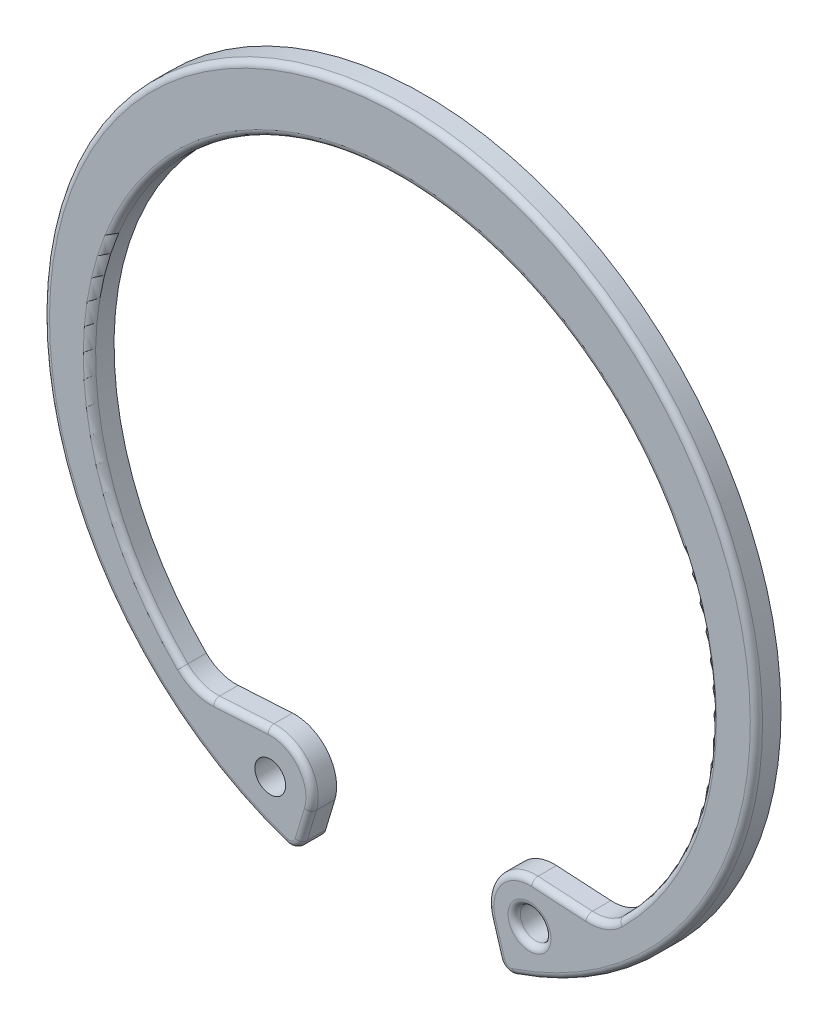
from build123d import *

# Parameters (mm, degrees)
ESQUISSE1_R          = 1.25
BASE_EXTRUSION_DEPTH = 2
CONG_1_R             = 1
CONG_2_R             = 0.5


with BuildPart() as part:
    # Esquisse1 → Base-Extrusion (new body)
    with BuildSketch(Plane.XY):
        with BuildLine():
            Line((7.286871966, -24.3043514), (8.328439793, -27.778356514))
            ThreePointArc((8.328439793, -27.778356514), (0, 29), (-8.328439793, -27.778356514))
            Line((-8.328439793, -27.778356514), (-7.286871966, -24.3043514))
            ThreePointArc((-7.286871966, -24.3043514), (-7.875785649, -21.220183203), (-10.739975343, -19.933586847))
            Line((-10.739975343, -19.933586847), (-15.158804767, -20.189175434))
            ThreePointArc((-15.158804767, -20.189175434), (-16.555225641, -19.976009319), (-17.744492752, -19.213726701))
            ThreePointArc((-17.744492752, -19.213726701), (0, 24), (17.744492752, -19.213726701))
            ThreePointArc((17.744492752, -19.213726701), (16.555225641, -19.976009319), (15.158804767, -20.189175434))
            Line((15.158804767, -20.189175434), (10.739975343, -19.933586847))
            ThreePointArc((10.739975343, -19.933586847), (7.875785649, -21.220183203), (7.286871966, -24.3043514))
        make_face()
        with Locations((10.543644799, -23.327913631)):
            Circle(ESQUISSE1_R, mode=Mode.SUBTRACT)
        with Locations(Location((-10.543644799, -23.327913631, 0), (0, 0, 180))):
            Circle(ESQUISSE1_R, mode=Mode.SUBTRACT)
    extrude(amount=BASE_EXTRUSION_DEPTH)

    # Cong_1
    cong_1_edges = [part.edges().sort_by_distance(p)[0] for p in [
        (8.328439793, -27.778356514, 1),
        (-8.328439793, -27.778356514, 1),
    ]]
    fillet(cong_1_edges, radius=CONG_1_R)

    # Cong_2
    cong_2_edges = [part.edges().sort_by_distance(p)[0] for p in [
        (-7.875785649, -21.220183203, 2),
        (-12.949390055, -20.06138114, 2),
        (-16.555225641, -19.976009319, 2),
        (0, 24, 2),
        (16.555225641, -19.976009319, 2),
        (9.293644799, -23.327913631, 2),
        (12.949390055, -20.06138114, 2),
        (7.875785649, -21.220183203, 2),
        (7.661497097, -25.553861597, 2),
        (0, 29, 2),
        (-7.661497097, -25.553861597, 2),
        (-8.53554885, -27.404905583, 2),
        (8.53554885, -27.404905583, 2),
    ]]
    fillet(cong_2_edges, radius=CONG_2_R)


solid = part.part
